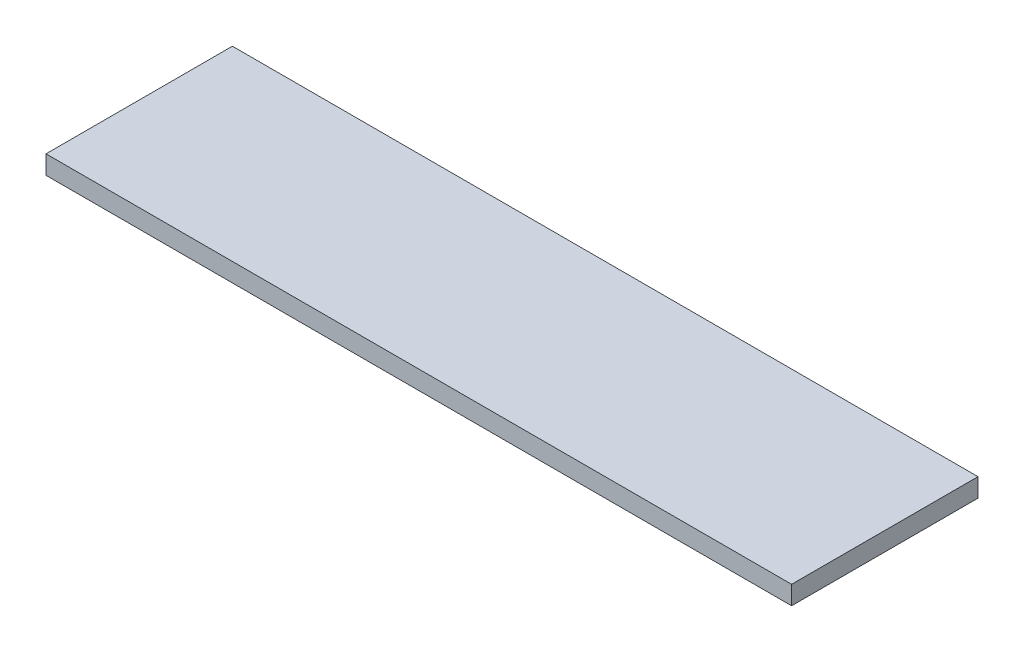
from build123d import *

# Parameters (mm, degrees)
SKETCH1_W      = 203.2
SKETCH1_H      = 50.8
EXTRUDE1_DEPTH = 5.08


with BuildPart() as part:
    # Sketch1 → Extrude1 (new body)
    with BuildSketch(Plane(origin=(0, 0, 0), x_dir=(1, 0, 0), z_dir=(0, 1, 0))):
        with Locations((101.6, 25.4)):
            Rectangle(SKETCH1_W, SKETCH1_H)
    extrude(amount=EXTRUDE1_DEPTH)


solid = part.part
